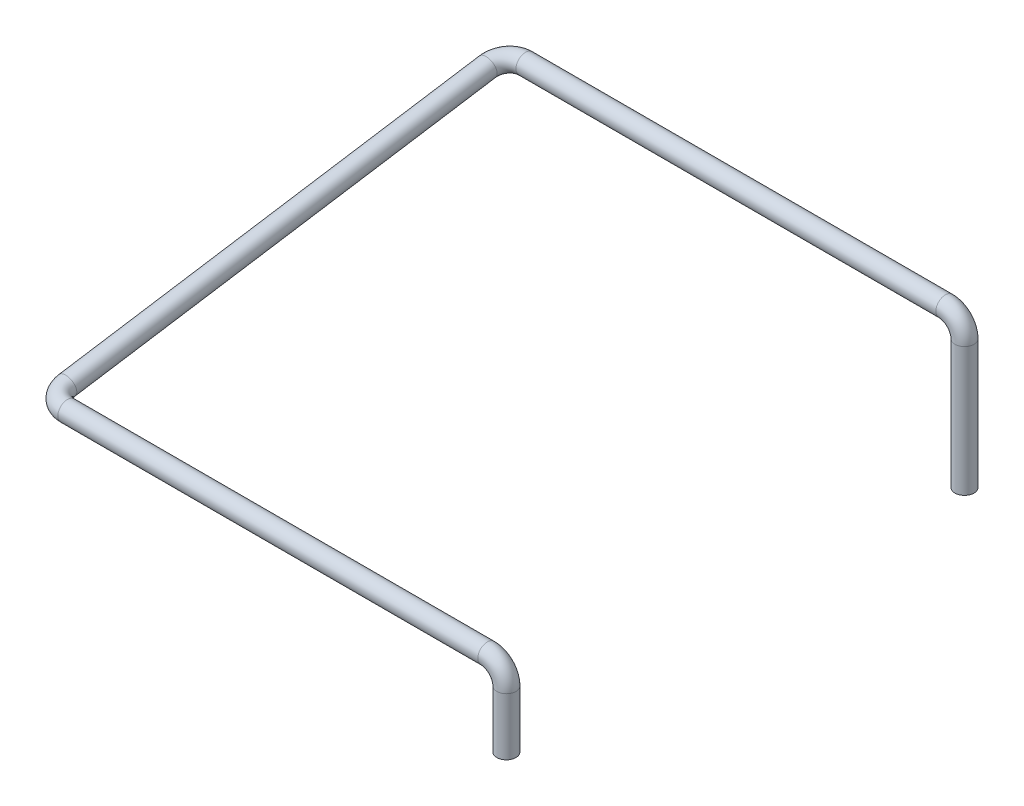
from build123d import *

# Parameters (mm, degrees)
SKETCH4_R = 0.5
SKETCH5_R = 0.5
SKETCH6_R = 0.5


with BuildPart() as part:
    # Sweep1: sweep along a path in Sketch1
    with BuildLine(Plane.XY) as sweep1_path:
        Line((0, 0), (22, 0))
        ThreePointArc((22, 0), (22.707106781, -0.292893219), (23, -1))
        Line((23, -1), (23, -4))
    # Sketch4 → Sweep1 (sweep)
    with BuildSketch(Plane(origin=(0, 0, 0), x_dir=(0, 0, -1), z_dir=(1, 0, 0))):
        Circle(SKETCH4_R)
    sweep(path=sweep1_path.line)

    # Sweep2: sweep along a path in Sketch3
    with BuildLine(Plane(origin=(0, 0, 0), x_dir=(-1, 0, 0), z_dir=(0, 0.9880120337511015, 0.1543768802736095))) as sweep2_path:
        ThreePointArc((0, -24.291202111), (0.707106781, -23.998308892), (1, -23.291202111))
        Line((1, -23.291202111), (1, -1))
        ThreePointArc((1, -1), (0.707106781, -0.292893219), (0, 0))
    # Sketch5 → Sweep2 (sweep)
    with BuildSketch(Plane.ZY):
        Circle(SKETCH5_R)
    sweep(path=sweep2_path.line)

    # Sweep3: sweep along a path in Sketch2
    with BuildLine(Plane.XY.offset(-24)) as sweep3_path:
        Line((0, 3.75), (22, 3.75))
        ThreePointArc((22, 3.75), (22.707106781, 3.457106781), (23, 2.75))
        Line((23, 2.75), (23, -4))
    # Sketch6 → Sweep3 (sweep)
    with BuildSketch(Plane(origin=(0, 0, 0), x_dir=(0, 0, -1), z_dir=(1, 0, 0))):
        with Locations((24, 3.75)):
            Circle(SKETCH6_R)
    sweep(path=sweep3_path.line)


solid = part.part
